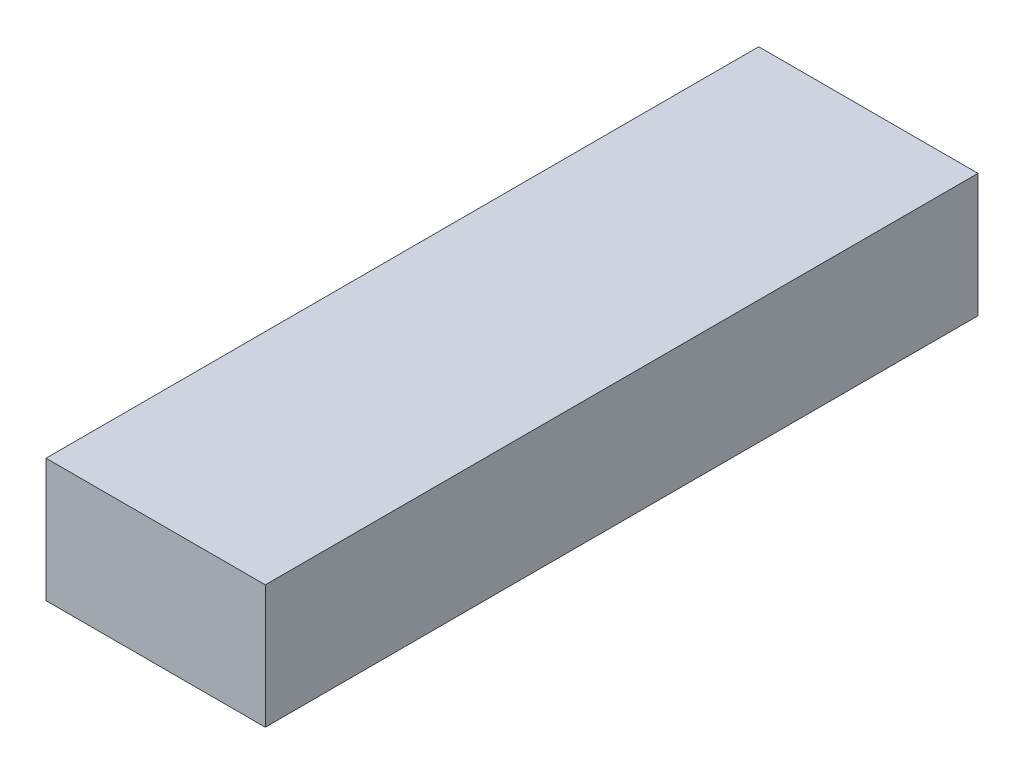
from build123d import *

# Parameters (mm, degrees)
SKETCH1_W           = 16
SKETCH1_H           = 9
BOSS_EXTRUDE1_DEPTH = 52


with BuildPart() as part:
    # Sketch1 → Boss-Extrude1 (new body)
    with BuildSketch(Plane.XY):
        Rectangle(SKETCH1_W, SKETCH1_H)
    extrude(amount=BOSS_EXTRUDE1_DEPTH)


solid = part.part
